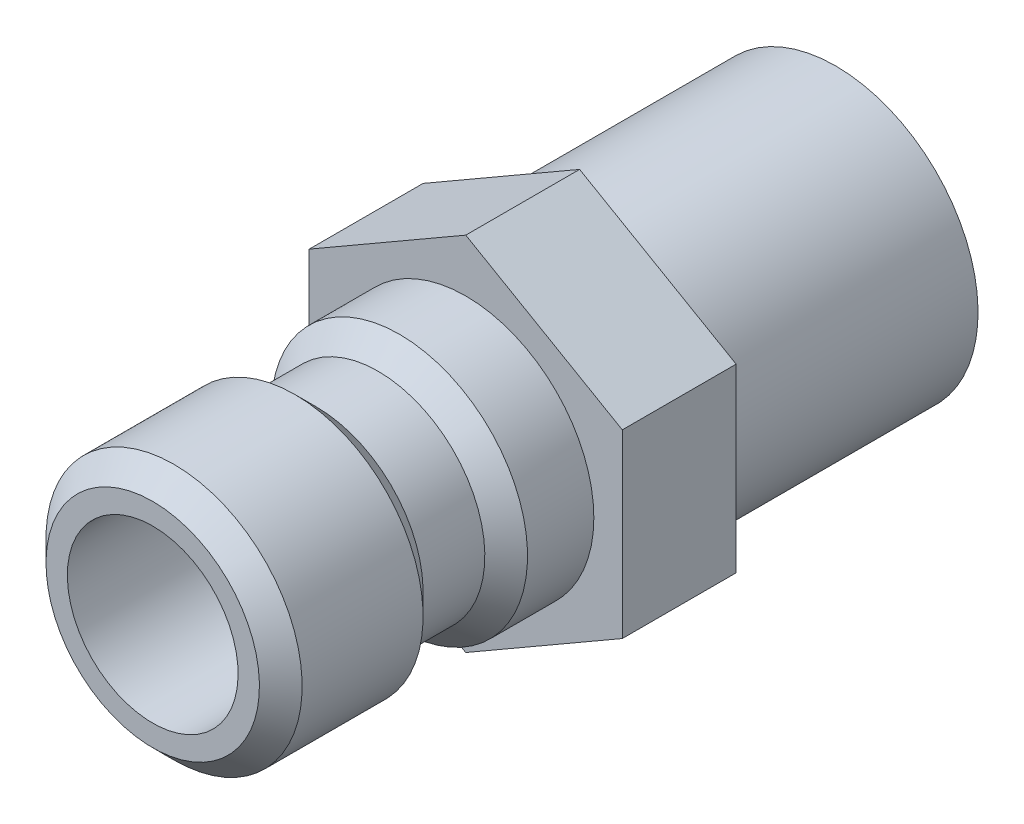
from build123d import *

# Parameters (mm, degrees)
SKETCH2_R           = 3
BOSS_EXTRUDE1_DEPTH = 4


with BuildPart() as part:
    # Sketch1 → Revolve1 (revolve)
    with BuildSketch(Plane(origin=(0, 0, 0), x_dir=(0, 0, -1), z_dir=(1, 0, 0))):
        Polygon((-11, 3), (-11, 3.75), (-10.25, 4.5), (-6, 4.5), (-5.25, 3.75), (-3.08, 3.75), (-2.33, 4.5), (4, 4.5), (4, 5), (6.142, 5), (13, 5), (13, 3), align=None)
    revolve(axis=Axis((0, 0, -4), (0, 0, 1)))

    # Sketch2 → Boss-Extrude1 (add)
    with BuildSketch(Plane.XY):
        Polygon((-5.5, 3.175426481), (-5.5, -3.175426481), (0, -6.350852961), (5.5, -3.175426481), (5.5, 3.175426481), (0, 6.350852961), align=None)
        with Locations(Location((0, 0, 0), (0, 0, 90))):
            Circle(SKETCH2_R, mode=Mode.SUBTRACT)
    extrude(amount=-BOSS_EXTRUDE1_DEPTH)


solid = part.part
